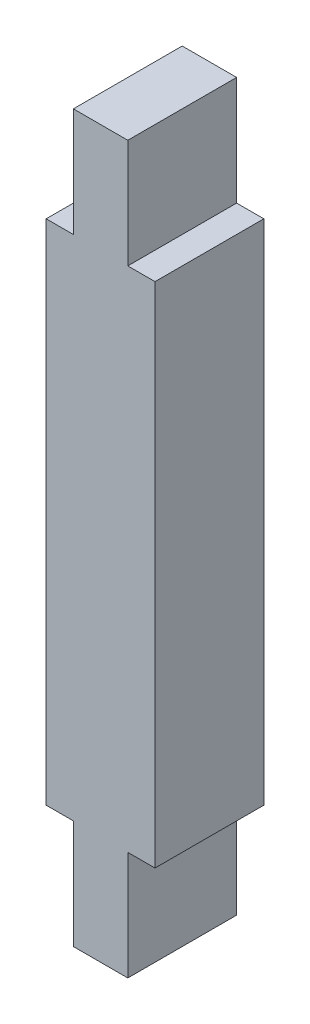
ISO-10303-21;
HEADER;
FILE_DESCRIPTION(('STEP AP214'),'2;1');
FILE_NAME('part.step','',(''),(''),'','','');
FILE_SCHEMA(('AUTOMOTIVE_DESIGN { 1 0 10303 214 1 1 1 1 }'));
ENDSEC;
DATA;
#1=APPLICATION_CONTEXT('core data for automotive mechanical design processes');
#2=APPLICATION_PROTOCOL_DEFINITION('international standard','automotive_design',2000,#1);
#3=PRODUCT_CONTEXT('',#1,'mechanical');
#4=PRODUCT('Part','Part','',(#3));
#5=PRODUCT_RELATED_PRODUCT_CATEGORY('part','',(#4));
#6=PRODUCT_DEFINITION_FORMATION('','',#4);
#7=PRODUCT_DEFINITION_CONTEXT('part definition',#1,'design');
#8=PRODUCT_DEFINITION('design','',#6,#7);
#9=PRODUCT_DEFINITION_SHAPE('','',#8);
#10=(LENGTH_UNIT() NAMED_UNIT(*) SI_UNIT(.MILLI.,.METRE.));
#11=(NAMED_UNIT(*) PLANE_ANGLE_UNIT() SI_UNIT($,.RADIAN.));
#12=(NAMED_UNIT(*) SI_UNIT($,.STERADIAN.) SOLID_ANGLE_UNIT());
#13=UNCERTAINTY_MEASURE_WITH_UNIT(LENGTH_MEASURE(1.E-05),#10,'distance_accuracy_value','');
#14=(GEOMETRIC_REPRESENTATION_CONTEXT(3) GLOBAL_UNCERTAINTY_ASSIGNED_CONTEXT((#13)) GLOBAL_UNIT_ASSIGNED_CONTEXT((#10,
#11,#12)) REPRESENTATION_CONTEXT('',''));
#15=CARTESIAN_POINT('',(0.,0.,0.));
#16=DIRECTION('',(0.,0.,1.));
#17=DIRECTION('',(1.,0.,0.));
#18=AXIS2_PLACEMENT_3D('',#15,#16,#17);
#19=CARTESIAN_POINT('',(9.525,-19.05,19.05));
#20=DIRECTION('',(0.,1.,0.));
#21=DIRECTION('',(0.,0.,1.));
#22=AXIS2_PLACEMENT_3D('',#19,#20,#21);
#23=PLANE('',#22);
#24=DIRECTION('',(1.,0.,0.));
#25=VECTOR('',#24,1.);
#26=CARTESIAN_POINT('',(9.525,-19.05,0.));
#27=LINE('',#26,#25);
#28=CARTESIAN_POINT('',(4.7625,-19.05,0.));
#29=VERTEX_POINT('',#28);
#30=CARTESIAN_POINT('',(14.2875,-19.05,0.));
#31=VERTEX_POINT('',#30);
#32=EDGE_CURVE('E159',#29,#31,#27,.T.);
#33=ORIENTED_EDGE('',*,*,#32,.T.);
#34=DIRECTION('',(0.,0.,-1.));
#35=VECTOR('',#34,1.);
#36=CARTESIAN_POINT('',(14.2875,-19.05,19.05));
#37=LINE('',#36,#35);
#38=CARTESIAN_POINT('',(14.2875,-19.05,19.05));
#39=VERTEX_POINT('',#38);
#40=EDGE_CURVE('E11',#39,#31,#37,.T.);
#41=ORIENTED_EDGE('',*,*,#40,.F.);
#42=DIRECTION('',(1.,0.,0.));
#43=VECTOR('',#42,1.);
#44=CARTESIAN_POINT('',(9.525,-19.05,19.05));
#45=LINE('',#44,#43);
#46=CARTESIAN_POINT('',(4.7625,-19.05,19.05));
#47=VERTEX_POINT('',#46);
#48=EDGE_CURVE('E102',#47,#39,#45,.T.);
#49=ORIENTED_EDGE('',*,*,#48,.F.);
#50=DIRECTION('',(0.,0.,-1.));
#51=VECTOR('',#50,1.);
#52=CARTESIAN_POINT('',(4.7625,-19.05,19.05));
#53=LINE('',#52,#51);
#54=EDGE_CURVE('E158',#47,#29,#53,.T.);
#55=ORIENTED_EDGE('',*,*,#54,.T.);
#56=EDGE_LOOP('',(#33,#41,#49,#55));
#57=FACE_BOUND('',#56,.T.);
#58=ADVANCED_FACE('F35',(#57),#23,.F.);
#59=CARTESIAN_POINT('',(14.2875,-55.5793636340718,19.05));
#60=DIRECTION('',(1.,0.,0.));
#61=DIRECTION('',(0.,1.,0.));
#62=AXIS2_PLACEMENT_3D('',#59,#60,#61);
#63=PLANE('',#62);
#64=DIRECTION('',(0.,-1.,0.));
#65=VECTOR('',#64,1.);
#66=CARTESIAN_POINT('',(14.2875,-55.5793636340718,0.));
#67=LINE('',#66,#65);
#68=CARTESIAN_POINT('',(14.2875,0.,0.));
#69=VERTEX_POINT('',#68);
#70=EDGE_CURVE('E162',#69,#31,#67,.T.);
#71=ORIENTED_EDGE('',*,*,#70,.F.);
#72=DIRECTION('',(0.,0.,-1.));
#73=VECTOR('',#72,1.);
#74=CARTESIAN_POINT('',(14.2875,0.,19.05));
#75=LINE('',#74,#73);
#76=CARTESIAN_POINT('',(14.2875,0.,19.05));
#77=VERTEX_POINT('',#76);
#78=EDGE_CURVE('E43',#77,#69,#75,.T.);
#79=ORIENTED_EDGE('',*,*,#78,.F.);
#80=DIRECTION('',(0.,-1.,0.));
#81=VECTOR('',#80,1.);
#82=CARTESIAN_POINT('',(14.2875,-55.5793636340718,19.05));
#83=LINE('',#82,#81);
#84=EDGE_CURVE('E213',#77,#39,#83,.T.);
#85=ORIENTED_EDGE('',*,*,#84,.T.);
#86=ORIENTED_EDGE('',*,*,#40,.T.);
#87=EDGE_LOOP('',(#71,#79,#85,#86));
#88=FACE_BOUND('',#87,.T.);
#89=ADVANCED_FACE('F212',(#88),#63,.T.);
#90=CARTESIAN_POINT('',(9.525,0.,19.05));
#91=DIRECTION('',(0.,1.,0.));
#92=DIRECTION('',(0.,0.,1.));
#93=AXIS2_PLACEMENT_3D('',#90,#91,#92);
#94=PLANE('',#93);
#95=DIRECTION('',(1.,0.,0.));
#96=VECTOR('',#95,1.);
#97=CARTESIAN_POINT('',(9.525,0.,0.));
#98=LINE('',#97,#96);
#99=CARTESIAN_POINT('',(19.05,0.,0.));
#100=VERTEX_POINT('',#99);
#101=EDGE_CURVE('E165',#69,#100,#98,.T.);
#102=ORIENTED_EDGE('',*,*,#101,.T.);
#103=DIRECTION('',(0.,0.,-1.));
#104=VECTOR('',#103,1.);
#105=CARTESIAN_POINT('',(19.05,0.,19.05));
#106=LINE('',#105,#104);
#107=CARTESIAN_POINT('',(19.05,0.,19.05));
#108=VERTEX_POINT('',#107);
#109=EDGE_CURVE('E198',#108,#100,#106,.T.);
#110=ORIENTED_EDGE('',*,*,#109,.F.);
#111=DIRECTION('',(1.,0.,0.));
#112=VECTOR('',#111,1.);
#113=CARTESIAN_POINT('',(9.525,0.,19.05));
#114=LINE('',#113,#112);
#115=EDGE_CURVE('E144',#77,#108,#114,.T.);
#116=ORIENTED_EDGE('',*,*,#115,.F.);
#117=ORIENTED_EDGE('',*,*,#78,.T.);
#118=EDGE_LOOP('',(#102,#110,#116,#117));
#119=FACE_BOUND('',#118,.T.);
#120=ADVANCED_FACE('F203',(#119),#94,.F.);
#121=CARTESIAN_POINT('',(19.05,-55.5793636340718,19.05));
#122=DIRECTION('',(-1.,0.,0.));
#123=DIRECTION('',(0.,0.,1.));
#124=AXIS2_PLACEMENT_3D('',#121,#122,#123);
#125=PLANE('',#124);
#126=DIRECTION('',(0.,1.,0.));
#127=VECTOR('',#126,1.);
#128=CARTESIAN_POINT('',(19.05,-55.5793636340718,0.));
#129=LINE('',#128,#127);
#130=CARTESIAN_POINT('',(19.05,88.9,0.));
#131=VERTEX_POINT('',#130);
#132=EDGE_CURVE('E167',#100,#131,#129,.T.);
#133=ORIENTED_EDGE('',*,*,#132,.T.);
#134=DIRECTION('',(0.,0.,-1.));
#135=VECTOR('',#134,1.);
#136=CARTESIAN_POINT('',(19.05,88.9,19.05));
#137=LINE('',#136,#135);
#138=CARTESIAN_POINT('',(19.05,88.9,19.05));
#139=VERTEX_POINT('',#138);
#140=EDGE_CURVE('E196',#139,#131,#137,.T.);
#141=ORIENTED_EDGE('',*,*,#140,.F.);
#142=DIRECTION('',(0.,1.,0.));
#143=VECTOR('',#142,1.);
#144=CARTESIAN_POINT('',(19.05,-55.5793636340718,19.05));
#145=LINE('',#144,#143);
#146=EDGE_CURVE('E241',#108,#139,#145,.T.);
#147=ORIENTED_EDGE('',*,*,#146,.F.);
#148=ORIENTED_EDGE('',*,*,#109,.T.);
#149=EDGE_LOOP('',(#133,#141,#147,#148));
#150=FACE_BOUND('',#149,.T.);
#151=ADVANCED_FACE('F240',(#150),#125,.F.);
#152=CARTESIAN_POINT('',(9.525,88.9,19.05));
#153=DIRECTION('',(0.,1.,0.));
#154=DIRECTION('',(0.,0.,1.));
#155=AXIS2_PLACEMENT_3D('',#152,#153,#154);
#156=PLANE('',#155);
#157=DIRECTION('',(1.,0.,0.));
#158=VECTOR('',#157,1.);
#159=CARTESIAN_POINT('',(9.525,88.9,0.));
#160=LINE('',#159,#158);
#161=CARTESIAN_POINT('',(14.2875,88.9,0.));
#162=VERTEX_POINT('',#161);
#163=EDGE_CURVE('E170',#162,#131,#160,.T.);
#164=ORIENTED_EDGE('',*,*,#163,.F.);
#165=DIRECTION('',(0.,0.,-1.));
#166=VECTOR('',#165,1.);
#167=CARTESIAN_POINT('',(14.2875,88.9,19.05));
#168=LINE('',#167,#166);
#169=CARTESIAN_POINT('',(14.2875,88.9,19.05));
#170=VERTEX_POINT('',#169);
#171=EDGE_CURVE('E194',#170,#162,#168,.T.);
#172=ORIENTED_EDGE('',*,*,#171,.F.);
#173=DIRECTION('',(1.,0.,0.));
#174=VECTOR('',#173,1.);
#175=CARTESIAN_POINT('',(9.525,88.9,19.05));
#176=LINE('',#175,#174);
#177=EDGE_CURVE('E153',#170,#139,#176,.T.);
#178=ORIENTED_EDGE('',*,*,#177,.T.);
#179=ORIENTED_EDGE('',*,*,#140,.T.);
#180=EDGE_LOOP('',(#164,#172,#178,#179));
#181=FACE_BOUND('',#180,.T.);
#182=ADVANCED_FACE('F233',(#181),#156,.T.);
#183=CARTESIAN_POINT('',(14.2875,-55.5793636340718,19.05));
#184=DIRECTION('',(-1.,0.,0.));
#185=DIRECTION('',(0.,0.,1.));
#186=AXIS2_PLACEMENT_3D('',#183,#184,#185);
#187=PLANE('',#186);
#188=DIRECTION('',(0.,1.,0.));
#189=VECTOR('',#188,1.);
#190=CARTESIAN_POINT('',(14.2875,-55.5793636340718,0.));
#191=LINE('',#190,#189);
#192=CARTESIAN_POINT('',(14.2875,107.95,0.));
#193=VERTEX_POINT('',#192);
#194=EDGE_CURVE('E173',#162,#193,#191,.T.);
#195=ORIENTED_EDGE('',*,*,#194,.T.);
#196=DIRECTION('',(0.,0.,-1.));
#197=VECTOR('',#196,1.);
#198=CARTESIAN_POINT('',(14.2875,107.95,19.05));
#199=LINE('',#198,#197);
#200=CARTESIAN_POINT('',(14.2875,107.95,19.05));
#201=VERTEX_POINT('',#200);
#202=EDGE_CURVE('E192',#201,#193,#199,.T.);
#203=ORIENTED_EDGE('',*,*,#202,.F.);
#204=DIRECTION('',(0.,1.,0.));
#205=VECTOR('',#204,1.);
#206=CARTESIAN_POINT('',(14.2875,-55.5793636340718,19.05));
#207=LINE('',#206,#205);
#208=EDGE_CURVE('E243',#170,#201,#207,.T.);
#209=ORIENTED_EDGE('',*,*,#208,.F.);
#210=ORIENTED_EDGE('',*,*,#171,.T.);
#211=EDGE_LOOP('',(#195,#203,#209,#210));
#212=FACE_BOUND('',#211,.T.);
#213=ADVANCED_FACE('F247',(#212),#187,.F.);
#214=CARTESIAN_POINT('',(9.525,107.95,19.05));
#215=DIRECTION('',(0.,1.,0.));
#216=DIRECTION('',(0.,0.,1.));
#217=AXIS2_PLACEMENT_3D('',#214,#215,#216);
#218=PLANE('',#217);
#219=DIRECTION('',(1.,0.,0.));
#220=VECTOR('',#219,1.);
#221=CARTESIAN_POINT('',(9.525,107.95,0.));
#222=LINE('',#221,#220);
#223=CARTESIAN_POINT('',(4.7625,107.95,0.));
#224=VERTEX_POINT('',#223);
#225=EDGE_CURVE('E177',#224,#193,#222,.T.);
#226=ORIENTED_EDGE('',*,*,#225,.F.);
#227=DIRECTION('',(0.,0.,-1.));
#228=VECTOR('',#227,1.);
#229=CARTESIAN_POINT('',(4.7625,107.95,19.05));
#230=LINE('',#229,#228);
#231=CARTESIAN_POINT('',(4.7625,107.95,19.05));
#232=VERTEX_POINT('',#231);
#233=EDGE_CURVE('E190',#232,#224,#230,.T.);
#234=ORIENTED_EDGE('',*,*,#233,.F.);
#235=DIRECTION('',(1.,0.,0.));
#236=VECTOR('',#235,1.);
#237=CARTESIAN_POINT('',(9.525,107.95,19.05));
#238=LINE('',#237,#236);
#239=EDGE_CURVE('E246',#232,#201,#238,.T.);
#240=ORIENTED_EDGE('',*,*,#239,.T.);
#241=ORIENTED_EDGE('',*,*,#202,.T.);
#242=EDGE_LOOP('',(#226,#234,#240,#241));
#243=FACE_BOUND('',#242,.T.);
#244=ADVANCED_FACE('F227',(#243),#218,.T.);
#245=CARTESIAN_POINT('',(4.7625,-55.5793636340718,19.05));
#246=DIRECTION('',(-1.,0.,0.));
#247=DIRECTION('',(0.,0.,1.));
#248=AXIS2_PLACEMENT_3D('',#245,#246,#247);
#249=PLANE('',#248);
#250=DIRECTION('',(0.,1.,0.));
#251=VECTOR('',#250,1.);
#252=CARTESIAN_POINT('',(4.7625,-55.5793636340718,0.));
#253=LINE('',#252,#251);
#254=CARTESIAN_POINT('',(4.7625,88.9,0.));
#255=VERTEX_POINT('',#254);
#256=EDGE_CURVE('E180',#255,#224,#253,.T.);
#257=ORIENTED_EDGE('',*,*,#256,.F.);
#258=DIRECTION('',(0.,0.,-1.));
#259=VECTOR('',#258,1.);
#260=CARTESIAN_POINT('',(4.7625,88.9,19.05));
#261=LINE('',#260,#259);
#262=CARTESIAN_POINT('',(4.7625,88.9,19.05));
#263=VERTEX_POINT('',#262);
#264=EDGE_CURVE('E188',#263,#255,#261,.T.);
#265=ORIENTED_EDGE('',*,*,#264,.F.);
#266=DIRECTION('',(0.,1.,0.));
#267=VECTOR('',#266,1.);
#268=CARTESIAN_POINT('',(4.7625,-55.5793636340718,19.05));
#269=LINE('',#268,#267);
#270=EDGE_CURVE('E151',#263,#232,#269,.T.);
#271=ORIENTED_EDGE('',*,*,#270,.T.);
#272=ORIENTED_EDGE('',*,*,#233,.T.);
#273=EDGE_LOOP('',(#257,#265,#271,#272));
#274=FACE_BOUND('',#273,.T.);
#275=ADVANCED_FACE('F222',(#274),#249,.T.);
#276=CARTESIAN_POINT('',(0.,88.9,0.));
#277=VERTEX_POINT('',#276);
#278=EDGE_CURVE('E174',#277,#255,#160,.T.);
#279=ORIENTED_EDGE('',*,*,#278,.F.);
#280=DIRECTION('',(0.,0.,-1.));
#281=VECTOR('',#280,1.);
#282=CARTESIAN_POINT('',(0.,88.9,19.05));
#283=LINE('',#282,#281);
#284=CARTESIAN_POINT('',(0.,88.9,19.05));
#285=VERTEX_POINT('',#284);
#286=EDGE_CURVE('E138',#285,#277,#283,.T.);
#287=ORIENTED_EDGE('',*,*,#286,.F.);
#288=EDGE_CURVE('E149',#285,#263,#176,.T.);
#289=ORIENTED_EDGE('',*,*,#288,.T.);
#290=ORIENTED_EDGE('',*,*,#264,.T.);
#291=EDGE_LOOP('',(#279,#287,#289,#290));
#292=FACE_BOUND('',#291,.T.);
#293=ADVANCED_FACE('F219',(#292),#156,.T.);
#294=CARTESIAN_POINT('',(0.,-55.5793636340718,19.05));
#295=DIRECTION('',(-1.,0.,0.));
#296=DIRECTION('',(0.,0.,1.));
#297=AXIS2_PLACEMENT_3D('',#294,#295,#296);
#298=PLANE('',#297);
#299=DIRECTION('',(0.,1.,0.));
#300=VECTOR('',#299,1.);
#301=CARTESIAN_POINT('',(0.,-55.5793636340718,0.));
#302=LINE('',#301,#300);
#303=CARTESIAN_POINT('',(0.,0.,0.));
#304=VERTEX_POINT('',#303);
#305=EDGE_CURVE('E137',#304,#277,#302,.T.);
#306=ORIENTED_EDGE('',*,*,#305,.F.);
#307=DIRECTION('',(0.,0.,-1.));
#308=VECTOR('',#307,1.);
#309=CARTESIAN_POINT('',(0.,0.,19.05));
#310=LINE('',#309,#308);
#311=CARTESIAN_POINT('',(0.,0.,19.05));
#312=VERTEX_POINT('',#311);
#313=EDGE_CURVE('E131',#312,#304,#310,.T.);
#314=ORIENTED_EDGE('',*,*,#313,.F.);
#315=DIRECTION('',(0.,1.,0.));
#316=VECTOR('',#315,1.);
#317=CARTESIAN_POINT('',(0.,-55.5793636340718,19.05));
#318=LINE('',#317,#316);
#319=EDGE_CURVE('E135',#312,#285,#318,.T.);
#320=ORIENTED_EDGE('',*,*,#319,.T.);
#321=ORIENTED_EDGE('',*,*,#286,.T.);
#322=EDGE_LOOP('',(#306,#314,#320,#321));
#323=FACE_BOUND('',#322,.T.);
#324=ADVANCED_FACE('F133',(#323),#298,.T.);
#325=CARTESIAN_POINT('',(4.76249999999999,0.,0.));
#326=VERTEX_POINT('',#325);
#327=EDGE_CURVE('E90',#304,#326,#98,.T.);
#328=ORIENTED_EDGE('',*,*,#327,.T.);
#329=DIRECTION('',(0.,0.,-1.));
#330=VECTOR('',#329,1.);
#331=CARTESIAN_POINT('',(4.76249999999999,0.,19.05));
#332=LINE('',#331,#330);
#333=CARTESIAN_POINT('',(4.76249999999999,0.,19.05));
#334=VERTEX_POINT('',#333);
#335=EDGE_CURVE('E139',#334,#326,#332,.T.);
#336=ORIENTED_EDGE('',*,*,#335,.F.);
#337=EDGE_CURVE('E141',#312,#334,#114,.T.);
#338=ORIENTED_EDGE('',*,*,#337,.F.);
#339=ORIENTED_EDGE('',*,*,#313,.T.);
#340=EDGE_LOOP('',(#328,#336,#338,#339));
#341=FACE_BOUND('',#340,.T.);
#342=ADVANCED_FACE('F142',(#341),#94,.F.);
#343=CARTESIAN_POINT('',(4.7625,-55.5793636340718,19.05));
#344=DIRECTION('',(1.,0.,0.));
#345=DIRECTION('',(0.,1.,0.));
#346=AXIS2_PLACEMENT_3D('',#343,#344,#345);
#347=PLANE('',#346);
#348=DIRECTION('',(0.,-1.,0.));
#349=VECTOR('',#348,1.);
#350=CARTESIAN_POINT('',(4.7625,-55.5793636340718,0.));
#351=LINE('',#350,#349);
#352=EDGE_CURVE('E96',#326,#29,#351,.T.);
#353=ORIENTED_EDGE('',*,*,#352,.T.);
#354=ORIENTED_EDGE('',*,*,#54,.F.);
#355=DIRECTION('',(0.,-1.,0.));
#356=VECTOR('',#355,1.);
#357=CARTESIAN_POINT('',(4.7625,-55.5793636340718,19.05));
#358=LINE('',#357,#356);
#359=EDGE_CURVE('E51',#334,#47,#358,.T.);
#360=ORIENTED_EDGE('',*,*,#359,.F.);
#361=ORIENTED_EDGE('',*,*,#335,.T.);
#362=EDGE_LOOP('',(#353,#354,#360,#361));
#363=FACE_BOUND('',#362,.T.);
#364=ADVANCED_FACE('F316',(#363),#347,.F.);
#365=CARTESIAN_POINT('',(9.525,-55.5793636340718,19.05));
#366=DIRECTION('',(0.,0.,1.));
#367=DIRECTION('',(1.,0.,0.));
#368=AXIS2_PLACEMENT_3D('',#365,#366,#367);
#369=PLANE('',#368);
#370=ORIENTED_EDGE('',*,*,#48,.T.);
#371=ORIENTED_EDGE('',*,*,#84,.F.);
#372=ORIENTED_EDGE('',*,*,#115,.T.);
#373=ORIENTED_EDGE('',*,*,#146,.T.);
#374=ORIENTED_EDGE('',*,*,#177,.F.);
#375=ORIENTED_EDGE('',*,*,#208,.T.);
#376=ORIENTED_EDGE('',*,*,#239,.F.);
#377=ORIENTED_EDGE('',*,*,#270,.F.);
#378=ORIENTED_EDGE('',*,*,#288,.F.);
#379=ORIENTED_EDGE('',*,*,#319,.F.);
#380=ORIENTED_EDGE('',*,*,#337,.T.);
#381=ORIENTED_EDGE('',*,*,#359,.T.);
#382=EDGE_LOOP('',(#370,#371,#372,#373,#374,#375,#376,#377,#378,#379,#380,#381));
#383=FACE_BOUND('',#382,.T.);
#384=ADVANCED_FACE('F146',(#383),#369,.T.);
#385=CARTESIAN_POINT('',(9.525,-55.5793636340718,0.));
#386=DIRECTION('',(0.,0.,1.));
#387=DIRECTION('',(1.,0.,0.));
#388=AXIS2_PLACEMENT_3D('',#385,#386,#387);
#389=PLANE('',#388);
#390=ORIENTED_EDGE('',*,*,#32,.F.);
#391=ORIENTED_EDGE('',*,*,#352,.F.);
#392=ORIENTED_EDGE('',*,*,#327,.F.);
#393=ORIENTED_EDGE('',*,*,#305,.T.);
#394=ORIENTED_EDGE('',*,*,#278,.T.);
#395=ORIENTED_EDGE('',*,*,#256,.T.);
#396=ORIENTED_EDGE('',*,*,#225,.T.);
#397=ORIENTED_EDGE('',*,*,#194,.F.);
#398=ORIENTED_EDGE('',*,*,#163,.T.);
#399=ORIENTED_EDGE('',*,*,#132,.F.);
#400=ORIENTED_EDGE('',*,*,#101,.F.);
#401=ORIENTED_EDGE('',*,*,#70,.T.);
#402=EDGE_LOOP('',(#390,#391,#392,#393,#394,#395,#396,#397,#398,#399,#400,#401));
#403=FACE_BOUND('',#402,.T.);
#404=ADVANCED_FACE('F211',(#403),#389,.F.);
#405=CLOSED_SHELL('',(#58,#89,#120,#151,#182,#213,#244,#275,#293,#324,#342,#364,#384,#404));
#406=MANIFOLD_SOLID_BREP('B2',#405);
#407=ADVANCED_BREP_SHAPE_REPRESENTATION('',(#18,#406),#14);
#408=SHAPE_DEFINITION_REPRESENTATION(#9,#407);
ENDSEC;
END-ISO-10303-21;
